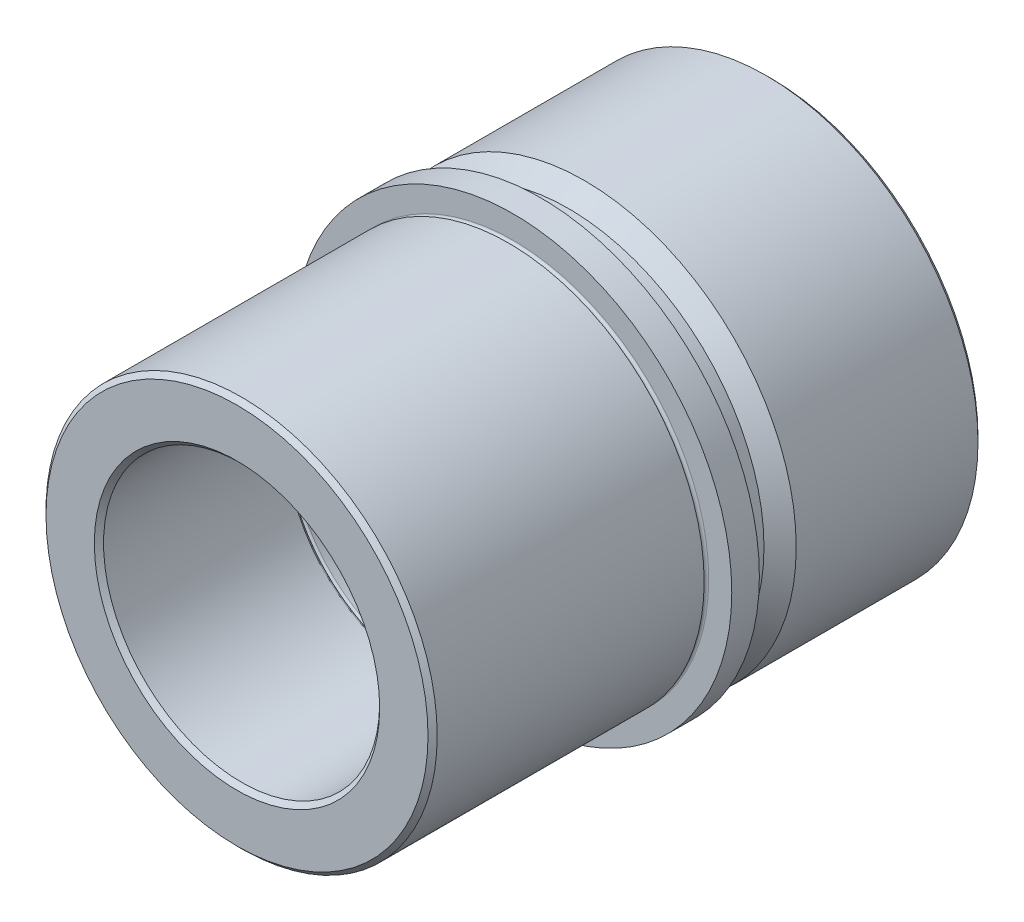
ISO-10303-21;
HEADER;
FILE_DESCRIPTION(('STEP AP214'),'2;1');
FILE_NAME('part.step','',(''),(''),'','','');
FILE_SCHEMA(('AUTOMOTIVE_DESIGN { 1 0 10303 214 1 1 1 1 }'));
ENDSEC;
DATA;
#1=APPLICATION_CONTEXT('core data for automotive mechanical design processes');
#2=APPLICATION_PROTOCOL_DEFINITION('international standard','automotive_design',2000,#1);
#3=PRODUCT_CONTEXT('',#1,'mechanical');
#4=PRODUCT('Part','Part','',(#3));
#5=PRODUCT_RELATED_PRODUCT_CATEGORY('part','',(#4));
#6=PRODUCT_DEFINITION_FORMATION('','',#4);
#7=PRODUCT_DEFINITION_CONTEXT('part definition',#1,'design');
#8=PRODUCT_DEFINITION('design','',#6,#7);
#9=PRODUCT_DEFINITION_SHAPE('','',#8);
#10=(LENGTH_UNIT() NAMED_UNIT(*) SI_UNIT(.MILLI.,.METRE.));
#11=(NAMED_UNIT(*) PLANE_ANGLE_UNIT() SI_UNIT($,.RADIAN.));
#12=(NAMED_UNIT(*) SI_UNIT($,.STERADIAN.) SOLID_ANGLE_UNIT());
#13=UNCERTAINTY_MEASURE_WITH_UNIT(LENGTH_MEASURE(1.E-05),#10,'distance_accuracy_value','');
#14=(GEOMETRIC_REPRESENTATION_CONTEXT(3) GLOBAL_UNCERTAINTY_ASSIGNED_CONTEXT((#13)) GLOBAL_UNIT_ASSIGNED_CONTEXT((#10,
#11,#12)) REPRESENTATION_CONTEXT('',''));
#15=CARTESIAN_POINT('',(0.,0.,0.));
#16=DIRECTION('',(0.,0.,1.));
#17=DIRECTION('',(1.,0.,0.));
#18=AXIS2_PLACEMENT_3D('',#15,#16,#17);
#19=CARTESIAN_POINT('',(0.,0.,-77.5));
#20=DIRECTION('',(0.,0.,1.));
#21=DIRECTION('',(1.,0.,0.));
#22=AXIS2_PLACEMENT_3D('',#19,#20,#21);
#23=TOROIDAL_SURFACE('',#22,30.5,0.5);
#24=CARTESIAN_POINT('',(0.,0.,-77.5));
#25=DIRECTION('',(0.,0.,1.));
#26=DIRECTION('',(1.,0.,0.));
#27=AXIS2_PLACEMENT_3D('',#24,#25,#26);
#28=CIRCLE('',#27,30.);
#29=CARTESIAN_POINT('',(30.,0.,-77.5));
#30=VERTEX_POINT('',#29);
#31=EDGE_CURVE('E81',#30,#30,#28,.T.);
#32=ORIENTED_EDGE('',*,*,#31,.T.);
#33=EDGE_LOOP('',(#32));
#34=FACE_BOUND('',#33,.T.);
#35=CARTESIAN_POINT('',(0.,0.,-78.));
#36=DIRECTION('',(0.,0.,1.));
#37=DIRECTION('',(1.,0.,0.));
#38=AXIS2_PLACEMENT_3D('',#35,#36,#37);
#39=CIRCLE('',#38,30.5);
#40=CARTESIAN_POINT('',(30.5,0.,-78.));
#41=VERTEX_POINT('',#40);
#42=EDGE_CURVE('E45',#41,#41,#39,.T.);
#43=ORIENTED_EDGE('',*,*,#42,.F.);
#44=EDGE_LOOP('',(#43));
#45=FACE_BOUND('',#44,.T.);
#46=ADVANCED_FACE('F13',(#34,#45),#23,.T.);
#47=CARTESIAN_POINT('',(0.,0.,-78.5));
#48=DIRECTION('',(0.,0.,1.));
#49=DIRECTION('',(1.,0.,0.));
#50=AXIS2_PLACEMENT_3D('',#47,#48,#49);
#51=TOROIDAL_SURFACE('',#50,30.5,0.5);
#52=CARTESIAN_POINT('',(0.,0.,-78.5));
#53=DIRECTION('',(0.,0.,1.));
#54=DIRECTION('',(1.,0.,0.));
#55=AXIS2_PLACEMENT_3D('',#52,#53,#54);
#56=CIRCLE('',#55,30.);
#57=CARTESIAN_POINT('',(30.,0.,-78.5));
#58=VERTEX_POINT('',#57);
#59=EDGE_CURVE('E48',#58,#58,#56,.T.);
#60=ORIENTED_EDGE('',*,*,#59,.F.);
#61=EDGE_LOOP('',(#60));
#62=FACE_BOUND('',#61,.T.);
#63=ORIENTED_EDGE('',*,*,#42,.T.);
#64=EDGE_LOOP('',(#63));
#65=FACE_BOUND('',#64,.T.);
#66=ADVANCED_FACE('F114',(#62,#65),#51,.T.);
#67=CARTESIAN_POINT('',(0.,0.,0.));
#68=DIRECTION('',(0.,0.,1.));
#69=DIRECTION('',(1.,0.,0.));
#70=AXIS2_PLACEMENT_3D('',#67,#68,#69);
#71=CYLINDRICAL_SURFACE('',#70,30.);
#72=CARTESIAN_POINT('',(0.,0.,-115.));
#73=DIRECTION('',(0.,0.,1.));
#74=DIRECTION('',(1.,0.,0.));
#75=AXIS2_PLACEMENT_3D('',#72,#73,#74);
#76=CIRCLE('',#75,30.);
#77=CARTESIAN_POINT('',(30.,0.,-115.));
#78=VERTEX_POINT('',#77);
#79=EDGE_CURVE('E36',#78,#78,#76,.F.);
#80=ORIENTED_EDGE('',*,*,#79,.T.);
#81=EDGE_LOOP('',(#80));
#82=FACE_BOUND('',#81,.T.);
#83=ORIENTED_EDGE('',*,*,#59,.T.);
#84=EDGE_LOOP('',(#83));
#85=FACE_BOUND('',#84,.T.);
#86=ADVANCED_FACE('F120',(#82,#85),#71,.F.);
#87=CARTESIAN_POINT('',(0.,-1.00613961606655E-13,-116.));
#88=DIRECTION('',(0.,0.,1.));
#89=DIRECTION('',(1.,0.,0.));
#90=AXIS2_PLACEMENT_3D('',#87,#88,#89);
#91=PLANE('',#90);
#92=CARTESIAN_POINT('',(0.,0.,-116.));
#93=DIRECTION('',(0.,0.,1.));
#94=DIRECTION('',(1.,0.,0.));
#95=AXIS2_PLACEMENT_3D('',#92,#93,#94);
#96=CIRCLE('',#95,31.);
#97=CARTESIAN_POINT('',(31.,0.,-116.));
#98=VERTEX_POINT('',#97);
#99=EDGE_CURVE('E39',#98,#98,#96,.T.);
#100=ORIENTED_EDGE('',*,*,#99,.T.);
#101=EDGE_LOOP('',(#100));
#102=FACE_BOUND('',#101,.T.);
#103=CARTESIAN_POINT('',(0.,0.,-116.));
#104=DIRECTION('',(0.,0.,1.));
#105=DIRECTION('',(1.,0.,0.));
#106=AXIS2_PLACEMENT_3D('',#103,#104,#105);
#107=CIRCLE('',#106,45.);
#108=CARTESIAN_POINT('',(45.,0.,-116.));
#109=VERTEX_POINT('',#108);
#110=EDGE_CURVE('E42',#109,#109,#107,.F.);
#111=ORIENTED_EDGE('',*,*,#110,.T.);
#112=EDGE_LOOP('',(#111));
#113=FACE_BOUND('',#112,.T.);
#114=ADVANCED_FACE('F185',(#102,#113),#91,.F.);
#115=CARTESIAN_POINT('',(0.,0.,0.));
#116=DIRECTION('',(0.,0.,1.));
#117=DIRECTION('',(1.,0.,0.));
#118=AXIS2_PLACEMENT_3D('',#115,#116,#117);
#119=CYLINDRICAL_SURFACE('',#118,46.);
#120=CARTESIAN_POINT('',(0.,0.,-115.));
#121=DIRECTION('',(0.,0.,1.));
#122=DIRECTION('',(1.,0.,0.));
#123=AXIS2_PLACEMENT_3D('',#120,#121,#122);
#124=CIRCLE('',#123,46.);
#125=CARTESIAN_POINT('',(46.,0.,-115.));
#126=VERTEX_POINT('',#125);
#127=EDGE_CURVE('E33',#126,#126,#124,.T.);
#128=ORIENTED_EDGE('',*,*,#127,.T.);
#129=EDGE_LOOP('',(#128));
#130=FACE_BOUND('',#129,.T.);
#131=CARTESIAN_POINT('',(0.,0.,-75.5));
#132=DIRECTION('',(0.,0.,1.));
#133=DIRECTION('',(1.,0.,0.));
#134=AXIS2_PLACEMENT_3D('',#131,#132,#133);
#135=CIRCLE('',#134,46.);
#136=CARTESIAN_POINT('',(46.,0.,-75.5));
#137=VERTEX_POINT('',#136);
#138=EDGE_CURVE('E51',#137,#137,#135,.T.);
#139=ORIENTED_EDGE('',*,*,#138,.F.);
#140=EDGE_LOOP('',(#139));
#141=FACE_BOUND('',#140,.T.);
#142=ADVANCED_FACE('F181',(#130,#141),#119,.T.);
#143=CARTESIAN_POINT('',(0.,0.,-72.));
#144=DIRECTION('',(0.,0.,-1.));
#145=DIRECTION('',(-1.,0.,0.));
#146=AXIS2_PLACEMENT_3D('',#143,#144,#145);
#147=CONICAL_SURFACE('',#146,42.5,0.78539816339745);
#148=ORIENTED_EDGE('',*,*,#138,.T.);
#149=EDGE_LOOP('',(#148));
#150=FACE_BOUND('',#149,.T.);
#151=CARTESIAN_POINT('',(0.,0.,-72.));
#152=DIRECTION('',(0.,0.,1.));
#153=DIRECTION('',(1.,0.,0.));
#154=AXIS2_PLACEMENT_3D('',#151,#152,#153);
#155=CIRCLE('',#154,42.5);
#156=CARTESIAN_POINT('',(42.5,0.,-72.));
#157=VERTEX_POINT('',#156);
#158=EDGE_CURVE('E54',#157,#157,#155,.T.);
#159=ORIENTED_EDGE('',*,*,#158,.F.);
#160=EDGE_LOOP('',(#159));
#161=FACE_BOUND('',#160,.T.);
#162=ADVANCED_FACE('F177',(#150,#161),#147,.T.);
#163=CARTESIAN_POINT('',(0.,0.,0.));
#164=DIRECTION('',(0.,0.,1.));
#165=DIRECTION('',(1.,0.,0.));
#166=AXIS2_PLACEMENT_3D('',#163,#164,#165);
#167=CYLINDRICAL_SURFACE('',#166,42.5);
#168=ORIENTED_EDGE('',*,*,#158,.T.);
#169=EDGE_LOOP('',(#168));
#170=FACE_BOUND('',#169,.T.);
#171=CARTESIAN_POINT('',(0.,0.,-66.));
#172=DIRECTION('',(0.,0.,1.));
#173=DIRECTION('',(1.,0.,0.));
#174=AXIS2_PLACEMENT_3D('',#171,#172,#173);
#175=CIRCLE('',#174,42.5);
#176=CARTESIAN_POINT('',(42.5,0.,-66.));
#177=VERTEX_POINT('',#176);
#178=EDGE_CURVE('E57',#177,#177,#175,.T.);
#179=ORIENTED_EDGE('',*,*,#178,.F.);
#180=EDGE_LOOP('',(#179));
#181=FACE_BOUND('',#180,.T.);
#182=ADVANCED_FACE('F173',(#170,#181),#167,.T.);
#183=CARTESIAN_POINT('',(0.,0.,-66.));
#184=DIRECTION('',(0.,0.,-1.));
#185=DIRECTION('',(-1.,0.,0.));
#186=AXIS2_PLACEMENT_3D('',#183,#184,#185);
#187=PLANE('',#186);
#188=ORIENTED_EDGE('',*,*,#178,.T.);
#189=EDGE_LOOP('',(#188));
#190=FACE_BOUND('',#189,.T.);
#191=CARTESIAN_POINT('',(0.,0.,-66.));
#192=DIRECTION('',(0.,0.,1.));
#193=DIRECTION('',(1.,0.,0.));
#194=AXIS2_PLACEMENT_3D('',#191,#192,#193);
#195=CIRCLE('',#194,47.5);
#196=CARTESIAN_POINT('',(47.5,0.,-66.));
#197=VERTEX_POINT('',#196);
#198=EDGE_CURVE('E60',#197,#197,#195,.T.);
#199=ORIENTED_EDGE('',*,*,#198,.F.);
#200=EDGE_LOOP('',(#199));
#201=FACE_BOUND('',#200,.T.);
#202=ADVANCED_FACE('F169',(#190,#201),#187,.T.);
#203=CARTESIAN_POINT('',(0.,0.,0.));
#204=DIRECTION('',(0.,0.,1.));
#205=DIRECTION('',(1.,0.,0.));
#206=AXIS2_PLACEMENT_3D('',#203,#204,#205);
#207=CYLINDRICAL_SURFACE('',#206,47.5);
#208=ORIENTED_EDGE('',*,*,#198,.T.);
#209=EDGE_LOOP('',(#208));
#210=FACE_BOUND('',#209,.T.);
#211=CARTESIAN_POINT('',(0.,0.,-60.));
#212=DIRECTION('',(0.,0.,1.));
#213=DIRECTION('',(1.,0.,0.));
#214=AXIS2_PLACEMENT_3D('',#211,#212,#213);
#215=CIRCLE('',#214,47.5);
#216=CARTESIAN_POINT('',(47.5,0.,-60.));
#217=VERTEX_POINT('',#216);
#218=EDGE_CURVE('E63',#217,#217,#215,.T.);
#219=ORIENTED_EDGE('',*,*,#218,.F.);
#220=EDGE_LOOP('',(#219));
#221=FACE_BOUND('',#220,.T.);
#222=ADVANCED_FACE('F165',(#210,#221),#207,.T.);
#223=CARTESIAN_POINT('',(0.,0.,-60.));
#224=DIRECTION('',(0.,0.,1.));
#225=DIRECTION('',(1.,0.,0.));
#226=AXIS2_PLACEMENT_3D('',#223,#224,#225);
#227=PLANE('',#226);
#228=ORIENTED_EDGE('',*,*,#218,.T.);
#229=EDGE_LOOP('',(#228));
#230=FACE_BOUND('',#229,.T.);
#231=CARTESIAN_POINT('',(0.,0.,-60.));
#232=DIRECTION('',(0.,0.,1.));
#233=DIRECTION('',(1.,0.,0.));
#234=AXIS2_PLACEMENT_3D('',#231,#232,#233);
#235=CIRCLE('',#234,42.5);
#236=CARTESIAN_POINT('',(42.5,0.,-60.));
#237=VERTEX_POINT('',#236);
#238=EDGE_CURVE('E66',#237,#237,#235,.T.);
#239=ORIENTED_EDGE('',*,*,#238,.F.);
#240=EDGE_LOOP('',(#239));
#241=FACE_BOUND('',#240,.T.);
#242=ADVANCED_FACE('F161',(#230,#241),#227,.T.);
#243=CARTESIAN_POINT('',(0.,0.,-59.5));
#244=DIRECTION('',(0.,0.,1.));
#245=DIRECTION('',(1.,0.,0.));
#246=AXIS2_PLACEMENT_3D('',#243,#244,#245);
#247=TOROIDAL_SURFACE('',#246,42.5,0.5);
#248=ORIENTED_EDGE('',*,*,#238,.T.);
#249=EDGE_LOOP('',(#248));
#250=FACE_BOUND('',#249,.T.);
#251=CARTESIAN_POINT('',(0.,0.,-59.));
#252=DIRECTION('',(0.,0.,1.));
#253=DIRECTION('',(1.,0.,0.));
#254=AXIS2_PLACEMENT_3D('',#251,#252,#253);
#255=CIRCLE('',#254,42.5);
#256=CARTESIAN_POINT('',(42.5,0.,-59.));
#257=VERTEX_POINT('',#256);
#258=EDGE_CURVE('E69',#257,#257,#255,.T.);
#259=ORIENTED_EDGE('',*,*,#258,.F.);
#260=EDGE_LOOP('',(#259));
#261=FACE_BOUND('',#260,.T.);
#262=ADVANCED_FACE('F156',(#250,#261),#247,.F.);
#263=CARTESIAN_POINT('',(0.,0.,0.));
#264=DIRECTION('',(0.,0.,1.));
#265=DIRECTION('',(1.,0.,0.));
#266=AXIS2_PLACEMENT_3D('',#263,#264,#265);
#267=CYLINDRICAL_SURFACE('',#266,42.5);
#268=CARTESIAN_POINT('',(0.,0.,-1.00000000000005));
#269=DIRECTION('',(0.,0.,1.));
#270=DIRECTION('',(1.,0.,0.));
#271=AXIS2_PLACEMENT_3D('',#268,#269,#270);
#272=CIRCLE('',#271,42.5);
#273=CARTESIAN_POINT('',(42.5,0.,-1.00000000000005));
#274=VERTEX_POINT('',#273);
#275=EDGE_CURVE('E8',#274,#274,#272,.F.);
#276=ORIENTED_EDGE('',*,*,#275,.T.);
#277=EDGE_LOOP('',(#276));
#278=FACE_BOUND('',#277,.T.);
#279=ORIENTED_EDGE('',*,*,#258,.T.);
#280=EDGE_LOOP('',(#279));
#281=FACE_BOUND('',#280,.T.);
#282=ADVANCED_FACE('F150',(#278,#281),#267,.T.);
#283=CARTESIAN_POINT('',(0.,0.,0.));
#284=DIRECTION('',(0.,0.,1.));
#285=DIRECTION('',(1.,0.,0.));
#286=AXIS2_PLACEMENT_3D('',#283,#284,#285);
#287=PLANE('',#286);
#288=CARTESIAN_POINT('',(0.,0.,0.));
#289=DIRECTION('',(0.,0.,1.));
#290=DIRECTION('',(1.,0.,0.));
#291=AXIS2_PLACEMENT_3D('',#288,#289,#290);
#292=CIRCLE('',#291,31.);
#293=CARTESIAN_POINT('',(31.,0.,0.));
#294=VERTEX_POINT('',#293);
#295=EDGE_CURVE('E20',#294,#294,#292,.F.);
#296=ORIENTED_EDGE('',*,*,#295,.T.);
#297=EDGE_LOOP('',(#296));
#298=FACE_BOUND('',#297,.T.);
#299=CARTESIAN_POINT('',(0.,0.,0.));
#300=DIRECTION('',(0.,0.,1.));
#301=DIRECTION('',(1.,0.,0.));
#302=AXIS2_PLACEMENT_3D('',#299,#300,#301);
#303=CIRCLE('',#302,41.5);
#304=CARTESIAN_POINT('',(41.5,0.,0.));
#305=VERTEX_POINT('',#304);
#306=EDGE_CURVE('E24',#305,#305,#303,.T.);
#307=ORIENTED_EDGE('',*,*,#306,.T.);
#308=EDGE_LOOP('',(#307));
#309=FACE_BOUND('',#308,.T.);
#310=ADVANCED_FACE('F110',(#298,#309),#287,.T.);
#311=CARTESIAN_POINT('',(0.,0.,0.));
#312=DIRECTION('',(0.,0.,1.));
#313=DIRECTION('',(1.,0.,0.));
#314=AXIS2_PLACEMENT_3D('',#311,#312,#313);
#315=CYLINDRICAL_SURFACE('',#314,30.);
#316=CARTESIAN_POINT('',(0.,0.,-1.));
#317=DIRECTION('',(0.,0.,1.));
#318=DIRECTION('',(1.,0.,0.));
#319=AXIS2_PLACEMENT_3D('',#316,#317,#318);
#320=CIRCLE('',#319,30.);
#321=CARTESIAN_POINT('',(30.,0.,-1.));
#322=VERTEX_POINT('',#321);
#323=EDGE_CURVE('E28',#322,#322,#320,.T.);
#324=ORIENTED_EDGE('',*,*,#323,.T.);
#325=EDGE_LOOP('',(#324));
#326=FACE_BOUND('',#325,.T.);
#327=CARTESIAN_POINT('',(0.,0.,-40.5));
#328=DIRECTION('',(0.,0.,1.));
#329=DIRECTION('',(1.,0.,0.));
#330=AXIS2_PLACEMENT_3D('',#327,#328,#329);
#331=CIRCLE('',#330,30.);
#332=CARTESIAN_POINT('',(30.,0.,-40.5));
#333=VERTEX_POINT('',#332);
#334=EDGE_CURVE('E72',#333,#333,#331,.T.);
#335=ORIENTED_EDGE('',*,*,#334,.F.);
#336=EDGE_LOOP('',(#335));
#337=FACE_BOUND('',#336,.T.);
#338=ADVANCED_FACE('F102',(#326,#337),#315,.F.);
#339=CARTESIAN_POINT('',(0.,0.,-40.5));
#340=DIRECTION('',(0.,0.,1.));
#341=DIRECTION('',(1.,0.,0.));
#342=AXIS2_PLACEMENT_3D('',#339,#340,#341);
#343=TOROIDAL_SURFACE('',#342,30.5,0.5);
#344=ORIENTED_EDGE('',*,*,#334,.T.);
#345=EDGE_LOOP('',(#344));
#346=FACE_BOUND('',#345,.T.);
#347=CARTESIAN_POINT('',(0.,0.,-41.));
#348=DIRECTION('',(0.,0.,1.));
#349=DIRECTION('',(1.,0.,0.));
#350=AXIS2_PLACEMENT_3D('',#347,#348,#349);
#351=CIRCLE('',#350,30.5);
#352=CARTESIAN_POINT('',(30.5,0.,-41.));
#353=VERTEX_POINT('',#352);
#354=EDGE_CURVE('E75',#353,#353,#351,.T.);
#355=ORIENTED_EDGE('',*,*,#354,.F.);
#356=EDGE_LOOP('',(#355));
#357=FACE_BOUND('',#356,.T.);
#358=ADVANCED_FACE('F97',(#346,#357),#343,.T.);
#359=CARTESIAN_POINT('',(0.,0.,-41.5));
#360=DIRECTION('',(0.,0.,1.));
#361=DIRECTION('',(1.,0.,0.));
#362=AXIS2_PLACEMENT_3D('',#359,#360,#361);
#363=TOROIDAL_SURFACE('',#362,30.5,0.49999999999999);
#364=CARTESIAN_POINT('',(0.,0.,-41.5));
#365=DIRECTION('',(0.,0.,1.));
#366=DIRECTION('',(1.,0.,0.));
#367=AXIS2_PLACEMENT_3D('',#364,#365,#366);
#368=CIRCLE('',#367,30.);
#369=CARTESIAN_POINT('',(30.,0.,-41.5));
#370=VERTEX_POINT('',#369);
#371=EDGE_CURVE('E78',#370,#370,#368,.T.);
#372=ORIENTED_EDGE('',*,*,#371,.F.);
#373=EDGE_LOOP('',(#372));
#374=FACE_BOUND('',#373,.T.);
#375=ORIENTED_EDGE('',*,*,#354,.T.);
#376=EDGE_LOOP('',(#375));
#377=FACE_BOUND('',#376,.T.);
#378=ADVANCED_FACE('F91',(#374,#377),#363,.T.);
#379=CARTESIAN_POINT('',(0.,0.,0.));
#380=DIRECTION('',(0.,0.,1.));
#381=DIRECTION('',(1.,0.,0.));
#382=AXIS2_PLACEMENT_3D('',#379,#380,#381);
#383=CYLINDRICAL_SURFACE('',#382,30.);
#384=ORIENTED_EDGE('',*,*,#31,.F.);
#385=EDGE_LOOP('',(#384));
#386=FACE_BOUND('',#385,.T.);
#387=ORIENTED_EDGE('',*,*,#371,.T.);
#388=EDGE_LOOP('',(#387));
#389=FACE_BOUND('',#388,.T.);
#390=ADVANCED_FACE('F87',(#386,#389),#383,.F.);
#391=CARTESIAN_POINT('',(0.,0.,-116.));
#392=DIRECTION('',(0.,0.,-1.));
#393=DIRECTION('',(-1.,0.,0.));
#394=AXIS2_PLACEMENT_3D('',#391,#392,#393);
#395=CONICAL_SURFACE('',#394,31.,0.785398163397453);
#396=ORIENTED_EDGE('',*,*,#79,.F.);
#397=EDGE_LOOP('',(#396));
#398=FACE_BOUND('',#397,.T.);
#399=ORIENTED_EDGE('',*,*,#99,.F.);
#400=EDGE_LOOP('',(#399));
#401=FACE_BOUND('',#400,.T.);
#402=ADVANCED_FACE('F90',(#398,#401),#395,.F.);
#403=CARTESIAN_POINT('',(0.,0.,-115.));
#404=DIRECTION('',(0.,0.,1.));
#405=DIRECTION('',(1.,0.,0.));
#406=AXIS2_PLACEMENT_3D('',#403,#404,#405);
#407=CONICAL_SURFACE('',#406,46.,0.785398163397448);
#408=ORIENTED_EDGE('',*,*,#110,.F.);
#409=EDGE_LOOP('',(#408));
#410=FACE_BOUND('',#409,.T.);
#411=ORIENTED_EDGE('',*,*,#127,.F.);
#412=EDGE_LOOP('',(#411));
#413=FACE_BOUND('',#412,.T.);
#414=ADVANCED_FACE('F127',(#410,#413),#407,.T.);
#415=CARTESIAN_POINT('',(0.,0.,-1.));
#416=DIRECTION('',(0.,0.,1.));
#417=DIRECTION('',(1.,0.,0.));
#418=AXIS2_PLACEMENT_3D('',#415,#416,#417);
#419=CONICAL_SURFACE('',#418,30.,0.785398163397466);
#420=ORIENTED_EDGE('',*,*,#295,.F.);
#421=EDGE_LOOP('',(#420));
#422=FACE_BOUND('',#421,.T.);
#423=ORIENTED_EDGE('',*,*,#323,.F.);
#424=EDGE_LOOP('',(#423));
#425=FACE_BOUND('',#424,.T.);
#426=ADVANCED_FACE('F130',(#422,#425),#419,.F.);
#427=CARTESIAN_POINT('',(0.,0.,0.));
#428=DIRECTION('',(0.,0.,-1.));
#429=DIRECTION('',(-1.,0.,0.));
#430=AXIS2_PLACEMENT_3D('',#427,#428,#429);
#431=CONICAL_SURFACE('',#430,41.5,0.785398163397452);
#432=ORIENTED_EDGE('',*,*,#275,.F.);
#433=EDGE_LOOP('',(#432));
#434=FACE_BOUND('',#433,.T.);
#435=ORIENTED_EDGE('',*,*,#306,.F.);
#436=EDGE_LOOP('',(#435));
#437=FACE_BOUND('',#436,.T.);
#438=ADVANCED_FACE('F15',(#434,#437),#431,.T.);
#439=CLOSED_SHELL('',(#46,#66,#86,#114,#142,#162,#182,#202,#222,#242,#262,#282,#310,#338,#358,
#378,#390,#402,#414,#426,#438));
#440=MANIFOLD_SOLID_BREP('B1',#439);
#441=ADVANCED_BREP_SHAPE_REPRESENTATION('',(#18,#440),#14);
#442=SHAPE_DEFINITION_REPRESENTATION(#9,#441);
ENDSEC;
END-ISO-10303-21;
